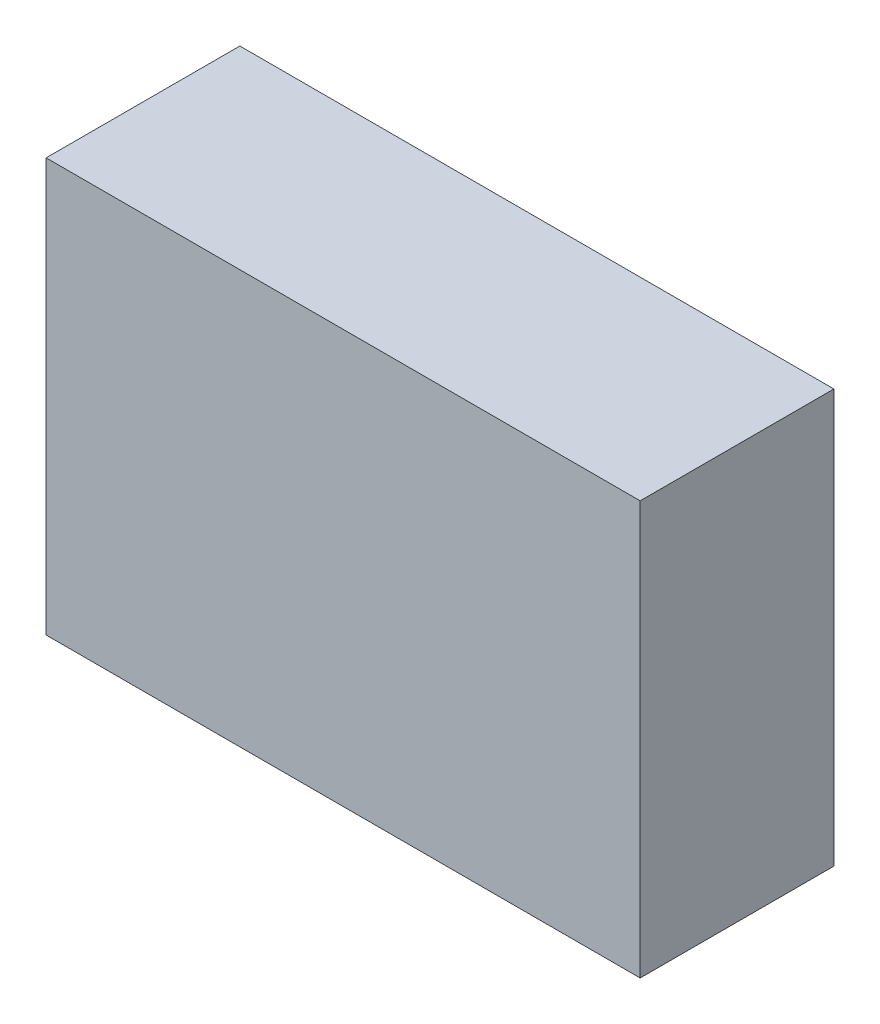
ISO-10303-21;
HEADER;
FILE_DESCRIPTION(('STEP AP214'),'2;1');
FILE_NAME('part.step','',(''),(''),'','','');
FILE_SCHEMA(('AUTOMOTIVE_DESIGN { 1 0 10303 214 1 1 1 1 }'));
ENDSEC;
DATA;
#1=APPLICATION_CONTEXT('core data for automotive mechanical design processes');
#2=APPLICATION_PROTOCOL_DEFINITION('international standard','automotive_design',2000,#1);
#3=PRODUCT_CONTEXT('',#1,'mechanical');
#4=PRODUCT('Part','Part','',(#3));
#5=PRODUCT_RELATED_PRODUCT_CATEGORY('part','',(#4));
#6=PRODUCT_DEFINITION_FORMATION('','',#4);
#7=PRODUCT_DEFINITION_CONTEXT('part definition',#1,'design');
#8=PRODUCT_DEFINITION('design','',#6,#7);
#9=PRODUCT_DEFINITION_SHAPE('','',#8);
#10=(LENGTH_UNIT() NAMED_UNIT(*) SI_UNIT(.MILLI.,.METRE.));
#11=(NAMED_UNIT(*) PLANE_ANGLE_UNIT() SI_UNIT($,.RADIAN.));
#12=(NAMED_UNIT(*) SI_UNIT($,.STERADIAN.) SOLID_ANGLE_UNIT());
#13=UNCERTAINTY_MEASURE_WITH_UNIT(LENGTH_MEASURE(1.E-05),#10,'distance_accuracy_value','');
#14=(GEOMETRIC_REPRESENTATION_CONTEXT(3) GLOBAL_UNCERTAINTY_ASSIGNED_CONTEXT((#13)) GLOBAL_UNIT_ASSIGNED_CONTEXT((#10,
#11,#12)) REPRESENTATION_CONTEXT('',''));
#15=CARTESIAN_POINT('',(0.,0.,0.));
#16=DIRECTION('',(0.,0.,1.));
#17=DIRECTION('',(1.,0.,0.));
#18=AXIS2_PLACEMENT_3D('',#15,#16,#17);
#19=CARTESIAN_POINT('',(0.,0.,15.));
#20=DIRECTION('',(0.,0.,1.));
#21=DIRECTION('',(1.,0.,0.));
#22=AXIS2_PLACEMENT_3D('',#19,#20,#21);
#23=PLANE('',#22);
#24=DIRECTION('',(-1.,0.,0.));
#25=VECTOR('',#24,1.);
#26=CARTESIAN_POINT('',(0.,-32.,15.));
#27=LINE('',#26,#25);
#28=CARTESIAN_POINT('',(46.,-32.,15.));
#29=VERTEX_POINT('',#28);
#30=CARTESIAN_POINT('',(-46.,-32.,15.));
#31=VERTEX_POINT('',#30);
#32=EDGE_CURVE('E11',#29,#31,#27,.T.);
#33=ORIENTED_EDGE('',*,*,#32,.F.);
#34=DIRECTION('',(0.,-1.,0.));
#35=VECTOR('',#34,1.);
#36=CARTESIAN_POINT('',(46.,0.,15.));
#37=LINE('',#36,#35);
#38=CARTESIAN_POINT('',(46.,32.,15.));
#39=VERTEX_POINT('',#38);
#40=EDGE_CURVE('E61',#39,#29,#37,.T.);
#41=ORIENTED_EDGE('',*,*,#40,.F.);
#42=DIRECTION('',(1.,0.,0.));
#43=VECTOR('',#42,1.);
#44=CARTESIAN_POINT('',(0.,32.,15.));
#45=LINE('',#44,#43);
#46=CARTESIAN_POINT('',(-46.,32.,15.));
#47=VERTEX_POINT('',#46);
#48=EDGE_CURVE('E87',#47,#39,#45,.T.);
#49=ORIENTED_EDGE('',*,*,#48,.F.);
#50=DIRECTION('',(0.,1.,0.));
#51=VECTOR('',#50,1.);
#52=CARTESIAN_POINT('',(-46.,0.,15.));
#53=LINE('',#52,#51);
#54=EDGE_CURVE('E24',#31,#47,#53,.T.);
#55=ORIENTED_EDGE('',*,*,#54,.F.);
#56=EDGE_LOOP('',(#33,#41,#49,#55));
#57=FACE_BOUND('',#56,.T.);
#58=ADVANCED_FACE('F17',(#57),#23,.T.);
#59=CARTESIAN_POINT('',(0.,-32.,-15.));
#60=DIRECTION('',(0.,-1.,0.));
#61=DIRECTION('',(0.,0.,-1.));
#62=AXIS2_PLACEMENT_3D('',#59,#60,#61);
#63=PLANE('',#62);
#64=DIRECTION('',(0.,0.,1.));
#65=VECTOR('',#64,1.);
#66=CARTESIAN_POINT('',(46.,-32.,-15.));
#67=LINE('',#66,#65);
#68=CARTESIAN_POINT('',(46.,-32.,-15.));
#69=VERTEX_POINT('',#68);
#70=EDGE_CURVE('E53',#69,#29,#67,.T.);
#71=ORIENTED_EDGE('',*,*,#70,.T.);
#72=ORIENTED_EDGE('',*,*,#32,.T.);
#73=DIRECTION('',(0.,0.,1.));
#74=VECTOR('',#73,1.);
#75=CARTESIAN_POINT('',(-46.,-32.,-15.));
#76=LINE('',#75,#74);
#77=CARTESIAN_POINT('',(-46.,-32.,-15.));
#78=VERTEX_POINT('',#77);
#79=EDGE_CURVE('E70',#78,#31,#76,.T.);
#80=ORIENTED_EDGE('',*,*,#79,.F.);
#81=DIRECTION('',(1.,0.,0.));
#82=VECTOR('',#81,1.);
#83=CARTESIAN_POINT('',(0.,-32.,-15.));
#84=LINE('',#83,#82);
#85=EDGE_CURVE('E65',#78,#69,#84,.T.);
#86=ORIENTED_EDGE('',*,*,#85,.T.);
#87=EDGE_LOOP('',(#71,#72,#80,#86));
#88=FACE_BOUND('',#87,.T.);
#89=ADVANCED_FACE('F66',(#88),#63,.T.);
#90=CARTESIAN_POINT('',(-46.,0.,-15.));
#91=DIRECTION('',(-1.,0.,0.));
#92=DIRECTION('',(0.,0.,1.));
#93=AXIS2_PLACEMENT_3D('',#90,#91,#92);
#94=PLANE('',#93);
#95=ORIENTED_EDGE('',*,*,#79,.T.);
#96=ORIENTED_EDGE('',*,*,#54,.T.);
#97=DIRECTION('',(0.,0.,1.));
#98=VECTOR('',#97,1.);
#99=CARTESIAN_POINT('',(-46.,32.,-15.));
#100=LINE('',#99,#98);
#101=CARTESIAN_POINT('',(-46.,32.,-15.));
#102=VERTEX_POINT('',#101);
#103=EDGE_CURVE('E85',#102,#47,#100,.T.);
#104=ORIENTED_EDGE('',*,*,#103,.F.);
#105=DIRECTION('',(0.,-1.,0.));
#106=VECTOR('',#105,1.);
#107=CARTESIAN_POINT('',(-46.,0.,-15.));
#108=LINE('',#107,#106);
#109=EDGE_CURVE('E75',#102,#78,#108,.T.);
#110=ORIENTED_EDGE('',*,*,#109,.T.);
#111=EDGE_LOOP('',(#95,#96,#104,#110));
#112=FACE_BOUND('',#111,.T.);
#113=ADVANCED_FACE('F93',(#112),#94,.T.);
#114=CARTESIAN_POINT('',(0.,32.,-15.));
#115=DIRECTION('',(0.,1.,0.));
#116=DIRECTION('',(0.,0.,1.));
#117=AXIS2_PLACEMENT_3D('',#114,#115,#116);
#118=PLANE('',#117);
#119=ORIENTED_EDGE('',*,*,#103,.T.);
#120=ORIENTED_EDGE('',*,*,#48,.T.);
#121=DIRECTION('',(0.,0.,1.));
#122=VECTOR('',#121,1.);
#123=CARTESIAN_POINT('',(46.,32.,-15.));
#124=LINE('',#123,#122);
#125=CARTESIAN_POINT('',(46.,32.,-15.));
#126=VERTEX_POINT('',#125);
#127=EDGE_CURVE('E62',#126,#39,#124,.T.);
#128=ORIENTED_EDGE('',*,*,#127,.F.);
#129=DIRECTION('',(-1.,0.,0.));
#130=VECTOR('',#129,1.);
#131=CARTESIAN_POINT('',(0.,32.,-15.));
#132=LINE('',#131,#130);
#133=EDGE_CURVE('E76',#126,#102,#132,.T.);
#134=ORIENTED_EDGE('',*,*,#133,.T.);
#135=EDGE_LOOP('',(#119,#120,#128,#134));
#136=FACE_BOUND('',#135,.T.);
#137=ADVANCED_FACE('F90',(#136),#118,.T.);
#138=CARTESIAN_POINT('',(0.,0.,-15.));
#139=DIRECTION('',(0.,0.,-1.));
#140=DIRECTION('',(-1.,0.,0.));
#141=AXIS2_PLACEMENT_3D('',#138,#139,#140);
#142=PLANE('',#141);
#143=DIRECTION('',(0.,1.,0.));
#144=VECTOR('',#143,1.);
#145=CARTESIAN_POINT('',(46.,0.,-15.));
#146=LINE('',#145,#144);
#147=EDGE_CURVE('E56',#69,#126,#146,.T.);
#148=ORIENTED_EDGE('',*,*,#147,.F.);
#149=ORIENTED_EDGE('',*,*,#85,.F.);
#150=ORIENTED_EDGE('',*,*,#109,.F.);
#151=ORIENTED_EDGE('',*,*,#133,.F.);
#152=EDGE_LOOP('',(#148,#149,#150,#151));
#153=FACE_BOUND('',#152,.T.);
#154=ADVANCED_FACE('F72',(#153),#142,.T.);
#155=CARTESIAN_POINT('',(46.,0.,-15.));
#156=DIRECTION('',(1.,0.,0.));
#157=DIRECTION('',(0.,0.,-1.));
#158=AXIS2_PLACEMENT_3D('',#155,#156,#157);
#159=PLANE('',#158);
#160=ORIENTED_EDGE('',*,*,#147,.T.);
#161=ORIENTED_EDGE('',*,*,#127,.T.);
#162=ORIENTED_EDGE('',*,*,#40,.T.);
#163=ORIENTED_EDGE('',*,*,#70,.F.);
#164=EDGE_LOOP('',(#160,#161,#162,#163));
#165=FACE_BOUND('',#164,.T.);
#166=ADVANCED_FACE('F57',(#165),#159,.T.);
#167=CLOSED_SHELL('',(#58,#89,#113,#137,#154,#166));
#168=MANIFOLD_SOLID_BREP('B1',#167);
#169=ADVANCED_BREP_SHAPE_REPRESENTATION('',(#18,#168),#14);
#170=SHAPE_DEFINITION_REPRESENTATION(#9,#169);
ENDSEC;
END-ISO-10303-21;
